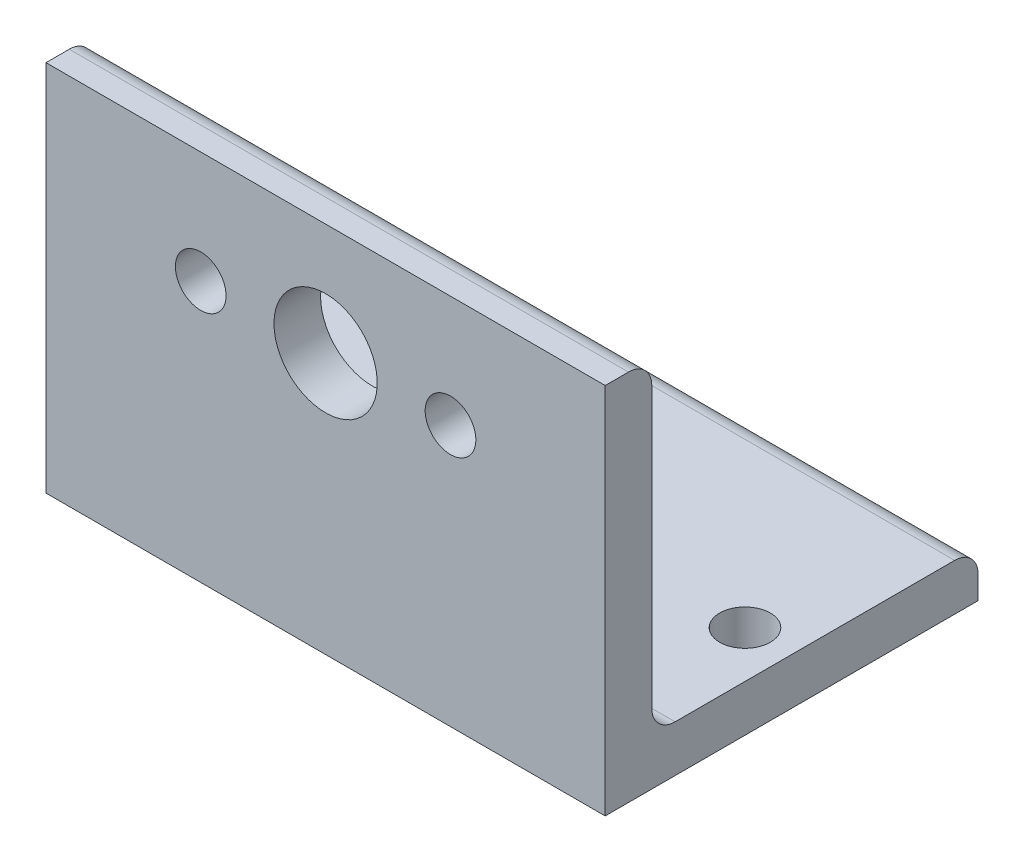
ISO-10303-21;
HEADER;
FILE_DESCRIPTION(('STEP AP214'),'2;1');
FILE_NAME('part.step','',(''),(''),'','','');
FILE_SCHEMA(('AUTOMOTIVE_DESIGN { 1 0 10303 214 1 1 1 1 }'));
ENDSEC;
DATA;
#1=APPLICATION_CONTEXT('core data for automotive mechanical design processes');
#2=APPLICATION_PROTOCOL_DEFINITION('international standard','automotive_design',2000,#1);
#3=PRODUCT_CONTEXT('',#1,'mechanical');
#4=PRODUCT('Part','Part','',(#3));
#5=PRODUCT_RELATED_PRODUCT_CATEGORY('part','',(#4));
#6=PRODUCT_DEFINITION_FORMATION('','',#4);
#7=PRODUCT_DEFINITION_CONTEXT('part definition',#1,'design');
#8=PRODUCT_DEFINITION('design','',#6,#7);
#9=PRODUCT_DEFINITION_SHAPE('','',#8);
#10=(LENGTH_UNIT() NAMED_UNIT(*) SI_UNIT(.MILLI.,.METRE.));
#11=(NAMED_UNIT(*) PLANE_ANGLE_UNIT() SI_UNIT($,.RADIAN.));
#12=(NAMED_UNIT(*) SI_UNIT($,.STERADIAN.) SOLID_ANGLE_UNIT());
#13=UNCERTAINTY_MEASURE_WITH_UNIT(LENGTH_MEASURE(1.E-05),#10,'distance_accuracy_value','');
#14=(GEOMETRIC_REPRESENTATION_CONTEXT(3) GLOBAL_UNCERTAINTY_ASSIGNED_CONTEXT((#13)) GLOBAL_UNIT_ASSIGNED_CONTEXT((#10,
#11,#12)) REPRESENTATION_CONTEXT('',''));
#15=CARTESIAN_POINT('',(0.,0.,0.));
#16=DIRECTION('',(0.,0.,1.));
#17=DIRECTION('',(1.,0.,0.));
#18=AXIS2_PLACEMENT_3D('',#15,#16,#17);
#19=CARTESIAN_POINT('',(38.1,25.4,0.));
#20=DIRECTION('',(0.,0.,-1.));
#21=DIRECTION('',(0.,1.,0.));
#22=AXIS2_PLACEMENT_3D('',#19,#20,#21);
#23=PLANE('',#22);
#24=CARTESIAN_POINT('',(27.559,17.78,0.));
#25=DIRECTION('',(0.,0.,-1.));
#26=DIRECTION('',(-1.,0.,0.));
#27=AXIS2_PLACEMENT_3D('',#24,#25,#26);
#28=CIRCLE('',#27,1.7272);
#29=CARTESIAN_POINT('',(25.8318,17.78,0.));
#30=VERTEX_POINT('',#29);
#31=EDGE_CURVE('E247',#30,#30,#28,.T.);
#32=ORIENTED_EDGE('',*,*,#31,.T.);
#33=EDGE_LOOP('',(#32));
#34=FACE_BOUND('',#33,.T.);
#35=CARTESIAN_POINT('',(10.541,17.78,0.));
#36=DIRECTION('',(0.,0.,-1.));
#37=DIRECTION('',(-1.,0.,0.));
#38=AXIS2_PLACEMENT_3D('',#35,#36,#37);
#39=CIRCLE('',#38,1.7272);
#40=CARTESIAN_POINT('',(8.8138,17.78,0.));
#41=VERTEX_POINT('',#40);
#42=EDGE_CURVE('E239',#41,#41,#39,.T.);
#43=ORIENTED_EDGE('',*,*,#42,.T.);
#44=EDGE_LOOP('',(#43));
#45=FACE_BOUND('',#44,.T.);
#46=CARTESIAN_POINT('',(19.05,17.78,0.));
#47=DIRECTION('',(0.,0.,-1.));
#48=DIRECTION('',(-1.,0.,0.));
#49=AXIS2_PLACEMENT_3D('',#46,#47,#48);
#50=CIRCLE('',#49,3.5179);
#51=CARTESIAN_POINT('',(15.5321,17.78,0.));
#52=VERTEX_POINT('',#51);
#53=EDGE_CURVE('E214',#52,#52,#50,.T.);
#54=ORIENTED_EDGE('',*,*,#53,.T.);
#55=EDGE_LOOP('',(#54));
#56=FACE_BOUND('',#55,.T.);
#57=DIRECTION('',(0.,-1.,0.));
#58=VECTOR('',#57,1.);
#59=CARTESIAN_POINT('',(0.,25.4,0.));
#60=LINE('',#59,#58);
#61=CARTESIAN_POINT('',(0.,25.4,0.));
#62=VERTEX_POINT('',#61);
#63=CARTESIAN_POINT('',(0.,0.,0.));
#64=VERTEX_POINT('',#63);
#65=EDGE_CURVE('E138',#62,#64,#60,.T.);
#66=ORIENTED_EDGE('',*,*,#65,.T.);
#67=DIRECTION('',(-1.,0.,0.));
#68=VECTOR('',#67,1.);
#69=CARTESIAN_POINT('',(38.1,0.,0.));
#70=LINE('',#69,#68);
#71=CARTESIAN_POINT('',(38.1,0.,0.));
#72=VERTEX_POINT('',#71);
#73=EDGE_CURVE('E118',#72,#64,#70,.T.);
#74=ORIENTED_EDGE('',*,*,#73,.F.);
#75=DIRECTION('',(0.,-1.,0.));
#76=VECTOR('',#75,1.);
#77=CARTESIAN_POINT('',(38.1,25.4,0.));
#78=LINE('',#77,#76);
#79=CARTESIAN_POINT('',(38.1,25.4,0.));
#80=VERTEX_POINT('',#79);
#81=EDGE_CURVE('E126',#80,#72,#78,.T.);
#82=ORIENTED_EDGE('',*,*,#81,.F.);
#83=DIRECTION('',(-1.,0.,0.));
#84=VECTOR('',#83,1.);
#85=CARTESIAN_POINT('',(38.1,25.4,0.));
#86=LINE('',#85,#84);
#87=EDGE_CURVE('E147',#80,#62,#86,.T.);
#88=ORIENTED_EDGE('',*,*,#87,.T.);
#89=EDGE_LOOP('',(#66,#74,#82,#88));
#90=FACE_BOUND('',#89,.T.);
#91=ADVANCED_FACE('F41',(#34,#45,#56,#90),#23,.F.);
#92=CARTESIAN_POINT('',(38.1,0.,0.));
#93=DIRECTION('',(0.,1.,0.));
#94=DIRECTION('',(0.,0.,1.));
#95=AXIS2_PLACEMENT_3D('',#92,#93,#94);
#96=PLANE('',#95);
#97=CARTESIAN_POINT('',(34.925,0.,-12.7));
#98=DIRECTION('',(0.,1.,0.));
#99=DIRECTION('',(0.,0.,1.));
#100=AXIS2_PLACEMENT_3D('',#97,#98,#99);
#101=CIRCLE('',#100,1.7272);
#102=CARTESIAN_POINT('',(34.925,0.,-10.9728));
#103=VERTEX_POINT('',#102);
#104=EDGE_CURVE('E263',#103,#103,#101,.T.);
#105=ORIENTED_EDGE('',*,*,#104,.T.);
#106=EDGE_LOOP('',(#105));
#107=FACE_BOUND('',#106,.T.);
#108=CARTESIAN_POINT('',(3.175,0.,-12.7));
#109=DIRECTION('',(0.,1.,0.));
#110=DIRECTION('',(0.,0.,1.));
#111=AXIS2_PLACEMENT_3D('',#108,#109,#110);
#112=CIRCLE('',#111,1.7272);
#113=CARTESIAN_POINT('',(3.175,0.,-10.9728));
#114=VERTEX_POINT('',#113);
#115=EDGE_CURVE('E255',#114,#114,#112,.T.);
#116=ORIENTED_EDGE('',*,*,#115,.T.);
#117=EDGE_LOOP('',(#116));
#118=FACE_BOUND('',#117,.T.);
#119=DIRECTION('',(0.,0.,-1.));
#120=VECTOR('',#119,1.);
#121=CARTESIAN_POINT('',(0.,0.,0.));
#122=LINE('',#121,#120);
#123=CARTESIAN_POINT('',(0.,0.,-25.4));
#124=VERTEX_POINT('',#123);
#125=EDGE_CURVE('E213',#64,#124,#122,.T.);
#126=ORIENTED_EDGE('',*,*,#125,.T.);
#127=DIRECTION('',(-1.,0.,0.));
#128=VECTOR('',#127,1.);
#129=CARTESIAN_POINT('',(38.1,0.,-25.4));
#130=LINE('',#129,#128);
#131=CARTESIAN_POINT('',(38.1,0.,-25.4));
#132=VERTEX_POINT('',#131);
#133=EDGE_CURVE('E121',#132,#124,#130,.T.);
#134=ORIENTED_EDGE('',*,*,#133,.F.);
#135=DIRECTION('',(0.,0.,-1.));
#136=VECTOR('',#135,1.);
#137=CARTESIAN_POINT('',(38.1,0.,0.));
#138=LINE('',#137,#136);
#139=EDGE_CURVE('E114',#72,#132,#138,.T.);
#140=ORIENTED_EDGE('',*,*,#139,.F.);
#141=ORIENTED_EDGE('',*,*,#73,.T.);
#142=EDGE_LOOP('',(#126,#134,#140,#141));
#143=FACE_BOUND('',#142,.T.);
#144=ADVANCED_FACE('F116',(#107,#118,#143),#96,.F.);
#145=CARTESIAN_POINT('',(38.1,0.,-25.4));
#146=DIRECTION('',(0.,0.,1.));
#147=DIRECTION('',(1.,0.,0.));
#148=AXIS2_PLACEMENT_3D('',#145,#146,#147);
#149=PLANE('',#148);
#150=DIRECTION('',(0.,1.,0.));
#151=VECTOR('',#150,1.);
#152=CARTESIAN_POINT('',(0.,0.,-25.4));
#153=LINE('',#152,#151);
#154=CARTESIAN_POINT('',(0.,1.5875,-25.4));
#155=VERTEX_POINT('',#154);
#156=EDGE_CURVE('E195',#124,#155,#153,.T.);
#157=ORIENTED_EDGE('',*,*,#156,.T.);
#158=DIRECTION('',(-1.,0.,0.));
#159=VECTOR('',#158,1.);
#160=CARTESIAN_POINT('',(38.1,1.5875,-25.4));
#161=LINE('',#160,#159);
#162=CARTESIAN_POINT('',(38.1,1.5875,-25.4));
#163=VERTEX_POINT('',#162);
#164=EDGE_CURVE('E160',#155,#163,#161,.F.);
#165=ORIENTED_EDGE('',*,*,#164,.T.);
#166=DIRECTION('',(0.,1.,0.));
#167=VECTOR('',#166,1.);
#168=CARTESIAN_POINT('',(38.1,0.,-25.4));
#169=LINE('',#168,#167);
#170=EDGE_CURVE('E125',#132,#163,#169,.T.);
#171=ORIENTED_EDGE('',*,*,#170,.F.);
#172=ORIENTED_EDGE('',*,*,#133,.T.);
#173=EDGE_LOOP('',(#157,#165,#171,#172));
#174=FACE_BOUND('',#173,.T.);
#175=ADVANCED_FACE('F229',(#174),#149,.F.);
#176=CARTESIAN_POINT('',(38.1,3.175,-25.4));
#177=DIRECTION('',(0.,-1.,0.));
#178=DIRECTION('',(0.,0.,-1.));
#179=AXIS2_PLACEMENT_3D('',#176,#177,#178);
#180=PLANE('',#179);
#181=CARTESIAN_POINT('',(34.925,3.175,-12.7));
#182=DIRECTION('',(0.,1.,0.));
#183=DIRECTION('',(0.,0.,1.));
#184=AXIS2_PLACEMENT_3D('',#181,#182,#183);
#185=CIRCLE('',#184,1.7272);
#186=CARTESIAN_POINT('',(34.925,3.175,-10.9728));
#187=VERTEX_POINT('',#186);
#188=EDGE_CURVE('E267',#187,#187,#185,.T.);
#189=ORIENTED_EDGE('',*,*,#188,.F.);
#190=EDGE_LOOP('',(#189));
#191=FACE_BOUND('',#190,.T.);
#192=CARTESIAN_POINT('',(3.175,3.175,-12.7));
#193=DIRECTION('',(0.,1.,0.));
#194=DIRECTION('',(0.,0.,1.));
#195=AXIS2_PLACEMENT_3D('',#192,#193,#194);
#196=CIRCLE('',#195,1.7272);
#197=CARTESIAN_POINT('',(3.175,3.175,-10.9728));
#198=VERTEX_POINT('',#197);
#199=EDGE_CURVE('E259',#198,#198,#196,.T.);
#200=ORIENTED_EDGE('',*,*,#199,.F.);
#201=EDGE_LOOP('',(#200));
#202=FACE_BOUND('',#201,.T.);
#203=DIRECTION('',(0.,0.,1.));
#204=VECTOR('',#203,1.);
#205=CARTESIAN_POINT('',(38.1,3.175,-25.4));
#206=LINE('',#205,#204);
#207=CARTESIAN_POINT('',(38.1,3.175,-23.8125));
#208=VERTEX_POINT('',#207);
#209=CARTESIAN_POINT('',(38.1,3.175,-4.7625));
#210=VERTEX_POINT('',#209);
#211=EDGE_CURVE('E200',#208,#210,#206,.T.);
#212=ORIENTED_EDGE('',*,*,#211,.F.);
#213=DIRECTION('',(-1.,0.,0.));
#214=VECTOR('',#213,1.);
#215=CARTESIAN_POINT('',(38.1,3.175,-23.8125));
#216=LINE('',#215,#214);
#217=CARTESIAN_POINT('',(0.,3.175,-23.8125));
#218=VERTEX_POINT('',#217);
#219=EDGE_CURVE('E145',#208,#218,#216,.T.);
#220=ORIENTED_EDGE('',*,*,#219,.T.);
#221=DIRECTION('',(0.,0.,1.));
#222=VECTOR('',#221,1.);
#223=CARTESIAN_POINT('',(0.,3.175,-25.4));
#224=LINE('',#223,#222);
#225=CARTESIAN_POINT('',(0.,3.175,-4.7625));
#226=VERTEX_POINT('',#225);
#227=EDGE_CURVE('E184',#218,#226,#224,.T.);
#228=ORIENTED_EDGE('',*,*,#227,.T.);
#229=DIRECTION('',(-1.,0.,0.));
#230=VECTOR('',#229,1.);
#231=CARTESIAN_POINT('',(38.1,3.175,-4.7625));
#232=LINE('',#231,#230);
#233=EDGE_CURVE('E140',#226,#210,#232,.F.);
#234=ORIENTED_EDGE('',*,*,#233,.T.);
#235=EDGE_LOOP('',(#212,#220,#228,#234));
#236=FACE_BOUND('',#235,.T.);
#237=ADVANCED_FACE('F191',(#191,#202,#236),#180,.F.);
#238=CARTESIAN_POINT('',(38.1,3.175,-3.175));
#239=DIRECTION('',(0.,0.,1.));
#240=DIRECTION('',(1.,0.,0.));
#241=AXIS2_PLACEMENT_3D('',#238,#239,#240);
#242=PLANE('',#241);
#243=CARTESIAN_POINT('',(27.559,17.78,-3.175));
#244=DIRECTION('',(0.,0.,-1.));
#245=DIRECTION('',(-1.,0.,0.));
#246=AXIS2_PLACEMENT_3D('',#243,#244,#245);
#247=CIRCLE('',#246,1.7272);
#248=CARTESIAN_POINT('',(25.8318,17.78,-3.175));
#249=VERTEX_POINT('',#248);
#250=EDGE_CURVE('E251',#249,#249,#247,.T.);
#251=ORIENTED_EDGE('',*,*,#250,.F.);
#252=EDGE_LOOP('',(#251));
#253=FACE_BOUND('',#252,.T.);
#254=CARTESIAN_POINT('',(10.541,17.78,-3.175));
#255=DIRECTION('',(0.,0.,-1.));
#256=DIRECTION('',(-1.,0.,0.));
#257=AXIS2_PLACEMENT_3D('',#254,#255,#256);
#258=CIRCLE('',#257,1.7272);
#259=CARTESIAN_POINT('',(8.8138,17.78,-3.175));
#260=VERTEX_POINT('',#259);
#261=EDGE_CURVE('E243',#260,#260,#258,.T.);
#262=ORIENTED_EDGE('',*,*,#261,.F.);
#263=EDGE_LOOP('',(#262));
#264=FACE_BOUND('',#263,.T.);
#265=CARTESIAN_POINT('',(19.05,17.78,-3.175));
#266=DIRECTION('',(0.,0.,-1.));
#267=DIRECTION('',(-1.,0.,0.));
#268=AXIS2_PLACEMENT_3D('',#265,#266,#267);
#269=CIRCLE('',#268,3.5179);
#270=CARTESIAN_POINT('',(15.5321,17.78,-3.175));
#271=VERTEX_POINT('',#270);
#272=EDGE_CURVE('E235',#271,#271,#269,.T.);
#273=ORIENTED_EDGE('',*,*,#272,.F.);
#274=EDGE_LOOP('',(#273));
#275=FACE_BOUND('',#274,.T.);
#276=DIRECTION('',(0.,1.,0.));
#277=VECTOR('',#276,1.);
#278=CARTESIAN_POINT('',(38.1,3.175,-3.175));
#279=LINE('',#278,#277);
#280=CARTESIAN_POINT('',(38.1,4.7625,-3.175));
#281=VERTEX_POINT('',#280);
#282=CARTESIAN_POINT('',(38.1,23.8125,-3.175));
#283=VERTEX_POINT('',#282);
#284=EDGE_CURVE('E199',#281,#283,#279,.T.);
#285=ORIENTED_EDGE('',*,*,#284,.F.);
#286=DIRECTION('',(-1.,0.,0.));
#287=VECTOR('',#286,1.);
#288=CARTESIAN_POINT('',(0.,4.7625,-3.175));
#289=LINE('',#288,#287);
#290=CARTESIAN_POINT('',(0.,4.7625,-3.175));
#291=VERTEX_POINT('',#290);
#292=EDGE_CURVE('E170',#281,#291,#289,.T.);
#293=ORIENTED_EDGE('',*,*,#292,.T.);
#294=DIRECTION('',(0.,1.,0.));
#295=VECTOR('',#294,1.);
#296=CARTESIAN_POINT('',(0.,3.175,-3.175));
#297=LINE('',#296,#295);
#298=CARTESIAN_POINT('',(0.,23.8125,-3.175));
#299=VERTEX_POINT('',#298);
#300=EDGE_CURVE('E185',#291,#299,#297,.T.);
#301=ORIENTED_EDGE('',*,*,#300,.T.);
#302=DIRECTION('',(-1.,0.,0.));
#303=VECTOR('',#302,1.);
#304=CARTESIAN_POINT('',(38.1,23.8125,-3.175));
#305=LINE('',#304,#303);
#306=EDGE_CURVE('E65',#299,#283,#305,.F.);
#307=ORIENTED_EDGE('',*,*,#306,.T.);
#308=EDGE_LOOP('',(#285,#293,#301,#307));
#309=FACE_BOUND('',#308,.T.);
#310=ADVANCED_FACE('F201',(#253,#264,#275,#309),#242,.F.);
#311=CARTESIAN_POINT('',(38.1,25.4,-3.175));
#312=DIRECTION('',(0.,-1.,0.));
#313=DIRECTION('',(0.,0.,-1.));
#314=AXIS2_PLACEMENT_3D('',#311,#312,#313);
#315=PLANE('',#314);
#316=DIRECTION('',(0.,0.,1.));
#317=VECTOR('',#316,1.);
#318=CARTESIAN_POINT('',(38.1,25.4,-3.175));
#319=LINE('',#318,#317);
#320=CARTESIAN_POINT('',(38.1,25.4,-1.5875));
#321=VERTEX_POINT('',#320);
#322=EDGE_CURVE('E130',#321,#80,#319,.T.);
#323=ORIENTED_EDGE('',*,*,#322,.F.);
#324=DIRECTION('',(-1.,0.,0.));
#325=VECTOR('',#324,1.);
#326=CARTESIAN_POINT('',(38.1,25.4,-1.5875));
#327=LINE('',#326,#325);
#328=CARTESIAN_POINT('',(0.,25.4,-1.5875));
#329=VERTEX_POINT('',#328);
#330=EDGE_CURVE('E174',#321,#329,#327,.T.);
#331=ORIENTED_EDGE('',*,*,#330,.T.);
#332=DIRECTION('',(0.,0.,1.));
#333=VECTOR('',#332,1.);
#334=CARTESIAN_POINT('',(0.,25.4,-3.175));
#335=LINE('',#334,#333);
#336=EDGE_CURVE('E135',#329,#62,#335,.T.);
#337=ORIENTED_EDGE('',*,*,#336,.T.);
#338=ORIENTED_EDGE('',*,*,#87,.F.);
#339=EDGE_LOOP('',(#323,#331,#337,#338));
#340=FACE_BOUND('',#339,.T.);
#341=ADVANCED_FACE('F323',(#340),#315,.F.);
#342=CARTESIAN_POINT('',(38.1,0.,0.));
#343=DIRECTION('',(1.,0.,0.));
#344=DIRECTION('',(0.,0.,-1.));
#345=AXIS2_PLACEMENT_3D('',#342,#343,#344);
#346=PLANE('',#345);
#347=ORIENTED_EDGE('',*,*,#170,.T.);
#348=CARTESIAN_POINT('',(38.1,1.5875,-23.8125));
#349=DIRECTION('',(1.,0.,0.));
#350=DIRECTION('',(0.,0.,-1.));
#351=AXIS2_PLACEMENT_3D('',#348,#349,#350);
#352=CIRCLE('',#351,1.5875);
#353=EDGE_CURVE('E165',#163,#208,#352,.T.);
#354=ORIENTED_EDGE('',*,*,#353,.T.);
#355=ORIENTED_EDGE('',*,*,#211,.T.);
#356=CARTESIAN_POINT('',(38.1,4.7625,-4.7625));
#357=DIRECTION('',(1.,0.,0.));
#358=DIRECTION('',(0.,0.,-1.));
#359=AXIS2_PLACEMENT_3D('',#356,#357,#358);
#360=CIRCLE('',#359,1.5875);
#361=EDGE_CURVE('E11',#210,#281,#360,.F.);
#362=ORIENTED_EDGE('',*,*,#361,.T.);
#363=ORIENTED_EDGE('',*,*,#284,.T.);
#364=CARTESIAN_POINT('',(38.1,23.8125,-1.5875));
#365=DIRECTION('',(1.,0.,0.));
#366=DIRECTION('',(0.,0.,-1.));
#367=AXIS2_PLACEMENT_3D('',#364,#365,#366);
#368=CIRCLE('',#367,1.5875);
#369=EDGE_CURVE('E57',#283,#321,#368,.T.);
#370=ORIENTED_EDGE('',*,*,#369,.T.);
#371=ORIENTED_EDGE('',*,*,#322,.T.);
#372=ORIENTED_EDGE('',*,*,#81,.T.);
#373=ORIENTED_EDGE('',*,*,#139,.T.);
#374=EDGE_LOOP('',(#347,#354,#355,#362,#363,#370,#371,#372,#373));
#375=FACE_BOUND('',#374,.T.);
#376=ADVANCED_FACE('F129',(#375),#346,.T.);
#377=CARTESIAN_POINT('',(0.,0.,0.));
#378=DIRECTION('',(1.,0.,0.));
#379=DIRECTION('',(0.,0.,-1.));
#380=AXIS2_PLACEMENT_3D('',#377,#378,#379);
#381=PLANE('',#380);
#382=ORIENTED_EDGE('',*,*,#227,.F.);
#383=CARTESIAN_POINT('',(0.,1.5875,-23.8125));
#384=DIRECTION('',(1.,0.,0.));
#385=DIRECTION('',(0.,0.,-1.));
#386=AXIS2_PLACEMENT_3D('',#383,#384,#385);
#387=CIRCLE('',#386,1.5875);
#388=EDGE_CURVE('E157',#218,#155,#387,.F.);
#389=ORIENTED_EDGE('',*,*,#388,.T.);
#390=ORIENTED_EDGE('',*,*,#156,.F.);
#391=ORIENTED_EDGE('',*,*,#125,.F.);
#392=ORIENTED_EDGE('',*,*,#65,.F.);
#393=ORIENTED_EDGE('',*,*,#336,.F.);
#394=CARTESIAN_POINT('',(0.,23.8125,-1.5875));
#395=DIRECTION('',(1.,0.,0.));
#396=DIRECTION('',(0.,0.,-1.));
#397=AXIS2_PLACEMENT_3D('',#394,#395,#396);
#398=CIRCLE('',#397,1.5875);
#399=EDGE_CURVE('E154',#329,#299,#398,.F.);
#400=ORIENTED_EDGE('',*,*,#399,.T.);
#401=ORIENTED_EDGE('',*,*,#300,.F.);
#402=CARTESIAN_POINT('',(0.,4.7625,-4.7625));
#403=DIRECTION('',(1.,0.,0.));
#404=DIRECTION('',(0.,0.,-1.));
#405=AXIS2_PLACEMENT_3D('',#402,#403,#404);
#406=CIRCLE('',#405,1.5875);
#407=EDGE_CURVE('E50',#291,#226,#406,.T.);
#408=ORIENTED_EDGE('',*,*,#407,.T.);
#409=EDGE_LOOP('',(#382,#389,#390,#391,#392,#393,#400,#401,#408));
#410=FACE_BOUND('',#409,.T.);
#411=ADVANCED_FACE('F183',(#410),#381,.F.);
#412=CARTESIAN_POINT('',(19.05,17.78,0.));
#413=DIRECTION('',(0.,0.,-1.));
#414=DIRECTION('',(-1.,0.,0.));
#415=AXIS2_PLACEMENT_3D('',#412,#413,#414);
#416=CYLINDRICAL_SURFACE('',#415,3.5179);
#417=CARTESIAN_POINT('',(15.5321,17.78,0.));
#418=CARTESIAN_POINT('',(15.5321,17.78,-0.0330729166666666));
#419=CARTESIAN_POINT('',(15.5321,17.78,-0.0661458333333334));
#420=CARTESIAN_POINT('',(15.5321,17.78,-0.132291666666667));
#421=CARTESIAN_POINT('',(15.5321,17.78,-0.165364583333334));
#422=CARTESIAN_POINT('',(15.5321,17.78,-0.231510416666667));
#423=CARTESIAN_POINT('',(15.5321,17.78,-0.264583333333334));
#424=CARTESIAN_POINT('',(15.5321,17.78,-0.330729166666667));
#425=CARTESIAN_POINT('',(15.5321,17.78,-0.363802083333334));
#426=CARTESIAN_POINT('',(15.5321,17.78,-0.429947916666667));
#427=CARTESIAN_POINT('',(15.5321,17.78,-0.463020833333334));
#428=CARTESIAN_POINT('',(15.5321,17.78,-0.529166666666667));
#429=CARTESIAN_POINT('',(15.5321,17.78,-0.562239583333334));
#430=CARTESIAN_POINT('',(15.5321,17.78,-0.628385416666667));
#431=CARTESIAN_POINT('',(15.5321,17.78,-0.661458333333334));
#432=CARTESIAN_POINT('',(15.5321,17.78,-0.727604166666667));
#433=CARTESIAN_POINT('',(15.5321,17.78,-0.760677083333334));
#434=CARTESIAN_POINT('',(15.5321,17.78,-0.826822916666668));
#435=CARTESIAN_POINT('',(15.5321,17.78,-0.859895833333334));
#436=CARTESIAN_POINT('',(15.5321,17.78,-0.926041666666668));
#437=CARTESIAN_POINT('',(15.5321,17.78,-0.959114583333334));
#438=CARTESIAN_POINT('',(15.5321,17.78,-1.02526041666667));
#439=CARTESIAN_POINT('',(15.5321,17.78,-1.05833333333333));
#440=CARTESIAN_POINT('',(15.5321,17.78,-1.12447916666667));
#441=CARTESIAN_POINT('',(15.5321,17.78,-1.15755208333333));
#442=CARTESIAN_POINT('',(15.5321,17.78,-1.22369791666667));
#443=CARTESIAN_POINT('',(15.5321,17.78,-1.25677083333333));
#444=CARTESIAN_POINT('',(15.5321,17.78,-1.32291666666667));
#445=CARTESIAN_POINT('',(15.5321,17.78,-1.35598958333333));
#446=CARTESIAN_POINT('',(15.5321,17.78,-1.42213541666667));
#447=CARTESIAN_POINT('',(15.5321,17.78,-1.45520833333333));
#448=CARTESIAN_POINT('',(15.5321,17.78,-1.52135416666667));
#449=CARTESIAN_POINT('',(15.5321,17.78,-1.55442708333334));
#450=CARTESIAN_POINT('',(15.5321,17.78,-1.62057291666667));
#451=CARTESIAN_POINT('',(15.5321,17.78,-1.65364583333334));
#452=CARTESIAN_POINT('',(15.5321,17.78,-1.71979166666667));
#453=CARTESIAN_POINT('',(15.5321,17.78,-1.75286458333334));
#454=CARTESIAN_POINT('',(15.5321,17.78,-1.81901041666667));
#455=CARTESIAN_POINT('',(15.5321,17.78,-1.85208333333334));
#456=CARTESIAN_POINT('',(15.5321,17.78,-1.91822916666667));
#457=CARTESIAN_POINT('',(15.5321,17.78,-1.95130208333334));
#458=CARTESIAN_POINT('',(15.5321,17.78,-2.01744791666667));
#459=CARTESIAN_POINT('',(15.5321,17.78,-2.05052083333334));
#460=CARTESIAN_POINT('',(15.5321,17.78,-2.11666666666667));
#461=CARTESIAN_POINT('',(15.5321,17.78,-2.14973958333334));
#462=CARTESIAN_POINT('',(15.5321,17.78,-2.21588541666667));
#463=CARTESIAN_POINT('',(15.5321,17.78,-2.24895833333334));
#464=CARTESIAN_POINT('',(15.5321,17.78,-2.31510416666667));
#465=CARTESIAN_POINT('',(15.5321,17.78,-2.34817708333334));
#466=CARTESIAN_POINT('',(15.5321,17.78,-2.41432291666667));
#467=CARTESIAN_POINT('',(15.5321,17.78,-2.44739583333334));
#468=CARTESIAN_POINT('',(15.5321,17.78,-2.51354166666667));
#469=CARTESIAN_POINT('',(15.5321,17.78,-2.54661458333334));
#470=CARTESIAN_POINT('',(15.5321,17.78,-2.61276041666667));
#471=CARTESIAN_POINT('',(15.5321,17.78,-2.64583333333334));
#472=CARTESIAN_POINT('',(15.5321,17.78,-2.71197916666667));
#473=CARTESIAN_POINT('',(15.5321,17.78,-2.74505208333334));
#474=CARTESIAN_POINT('',(15.5321,17.78,-2.81119791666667));
#475=CARTESIAN_POINT('',(15.5321,17.78,-2.84427083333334));
#476=CARTESIAN_POINT('',(15.5321,17.78,-2.91041666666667));
#477=CARTESIAN_POINT('',(15.5321,17.78,-2.94348958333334));
#478=CARTESIAN_POINT('',(15.5321,17.78,-3.00963541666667));
#479=CARTESIAN_POINT('',(15.5321,17.78,-3.04270833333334));
#480=CARTESIAN_POINT('',(15.5321,17.78,-3.10885416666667));
#481=CARTESIAN_POINT('',(15.5321,17.78,-3.14192708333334));
#482=CARTESIAN_POINT('',(15.5321,17.78,-3.175));
#483=B_SPLINE_CURVE_WITH_KNOTS('',3,(#417,#418,#419,#420,#421,#422,#423,#424,#425,#426,#427,
#428,#429,#430,#431,#432,#433,#434,#435,#436,#437,#438,#439,#440,#441,#442,#443,#444,#445,#446,
#447,#448,#449,#450,#451,#452,#453,#454,#455,#456,#457,#458,#459,#460,#461,#462,#463,#464,#465,
#466,#467,#468,#469,#470,#471,#472,#473,#474,#475,#476,#477,#478,#479,#480,#481,#482),
.UNSPECIFIED.,.F.,.F.,(4,2,2,2,2,2,2,2,2,2,2,2,2,2,2,2,2,2,2,2,2,2,2,2,2,2,2,2,2,2,2,2,4),(0.,
0.0992187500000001,0.1984375,0.29765625,0.396875,0.496093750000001,0.595312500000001,
0.694531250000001,0.793750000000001,0.892968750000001,0.992187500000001,1.09140625,1.190625,
1.28984375,1.3890625,1.48828125,1.5875,1.68671875,1.7859375,1.88515625,1.984375,2.08359375,
2.1828125,2.28203125,2.38125,2.48046875,2.5796875,2.67890625,2.778125,2.87734375,2.9765625,
3.07578125,3.175),.UNSPECIFIED.);
#484=EDGE_CURVE('BSEAM370',#52,#271,#483,.T.);
#485=ORIENTED_EDGE('',*,*,#53,.F.);
#486=ORIENTED_EDGE('',*,*,#272,.T.);
#487=ORIENTED_EDGE('',*,*,#484,.T.);
#488=ORIENTED_EDGE('',*,*,#484,.F.);
#489=EDGE_LOOP('',(#485,#487,#486,#488));
#490=FACE_BOUND('',#489,.T.);
#491=ADVANCED_FACE('F370',(#490),#416,.F.);
#492=CARTESIAN_POINT('',(10.541,17.78,0.));
#493=DIRECTION('',(0.,0.,-1.));
#494=DIRECTION('',(-1.,0.,0.));
#495=AXIS2_PLACEMENT_3D('',#492,#493,#494);
#496=CYLINDRICAL_SURFACE('',#495,1.7272);
#497=CARTESIAN_POINT('',(8.8138,17.78,0.));
#498=CARTESIAN_POINT('',(8.8138,17.78,-0.0330729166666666));
#499=CARTESIAN_POINT('',(8.8138,17.78,-0.0661458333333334));
#500=CARTESIAN_POINT('',(8.8138,17.78,-0.132291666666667));
#501=CARTESIAN_POINT('',(8.8138,17.78,-0.165364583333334));
#502=CARTESIAN_POINT('',(8.8138,17.78,-0.231510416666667));
#503=CARTESIAN_POINT('',(8.8138,17.78,-0.264583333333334));
#504=CARTESIAN_POINT('',(8.8138,17.78,-0.330729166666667));
#505=CARTESIAN_POINT('',(8.8138,17.78,-0.363802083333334));
#506=CARTESIAN_POINT('',(8.8138,17.78,-0.429947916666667));
#507=CARTESIAN_POINT('',(8.8138,17.78,-0.463020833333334));
#508=CARTESIAN_POINT('',(8.8138,17.78,-0.529166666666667));
#509=CARTESIAN_POINT('',(8.8138,17.78,-0.562239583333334));
#510=CARTESIAN_POINT('',(8.8138,17.78,-0.628385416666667));
#511=CARTESIAN_POINT('',(8.8138,17.78,-0.661458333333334));
#512=CARTESIAN_POINT('',(8.8138,17.78,-0.727604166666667));
#513=CARTESIAN_POINT('',(8.8138,17.78,-0.760677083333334));
#514=CARTESIAN_POINT('',(8.8138,17.78,-0.826822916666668));
#515=CARTESIAN_POINT('',(8.8138,17.78,-0.859895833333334));
#516=CARTESIAN_POINT('',(8.8138,17.78,-0.926041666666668));
#517=CARTESIAN_POINT('',(8.8138,17.78,-0.959114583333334));
#518=CARTESIAN_POINT('',(8.8138,17.78,-1.02526041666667));
#519=CARTESIAN_POINT('',(8.8138,17.78,-1.05833333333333));
#520=CARTESIAN_POINT('',(8.8138,17.78,-1.12447916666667));
#521=CARTESIAN_POINT('',(8.8138,17.78,-1.15755208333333));
#522=CARTESIAN_POINT('',(8.8138,17.78,-1.22369791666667));
#523=CARTESIAN_POINT('',(8.8138,17.78,-1.25677083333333));
#524=CARTESIAN_POINT('',(8.8138,17.78,-1.32291666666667));
#525=CARTESIAN_POINT('',(8.8138,17.78,-1.35598958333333));
#526=CARTESIAN_POINT('',(8.8138,17.78,-1.42213541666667));
#527=CARTESIAN_POINT('',(8.8138,17.78,-1.45520833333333));
#528=CARTESIAN_POINT('',(8.8138,17.78,-1.52135416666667));
#529=CARTESIAN_POINT('',(8.8138,17.78,-1.55442708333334));
#530=CARTESIAN_POINT('',(8.8138,17.78,-1.62057291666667));
#531=CARTESIAN_POINT('',(8.8138,17.78,-1.65364583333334));
#532=CARTESIAN_POINT('',(8.8138,17.78,-1.71979166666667));
#533=CARTESIAN_POINT('',(8.8138,17.78,-1.75286458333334));
#534=CARTESIAN_POINT('',(8.8138,17.78,-1.81901041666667));
#535=CARTESIAN_POINT('',(8.8138,17.78,-1.85208333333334));
#536=CARTESIAN_POINT('',(8.8138,17.78,-1.91822916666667));
#537=CARTESIAN_POINT('',(8.8138,17.78,-1.95130208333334));
#538=CARTESIAN_POINT('',(8.8138,17.78,-2.01744791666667));
#539=CARTESIAN_POINT('',(8.8138,17.78,-2.05052083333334));
#540=CARTESIAN_POINT('',(8.8138,17.78,-2.11666666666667));
#541=CARTESIAN_POINT('',(8.8138,17.78,-2.14973958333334));
#542=CARTESIAN_POINT('',(8.8138,17.78,-2.21588541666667));
#543=CARTESIAN_POINT('',(8.8138,17.78,-2.24895833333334));
#544=CARTESIAN_POINT('',(8.8138,17.78,-2.31510416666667));
#545=CARTESIAN_POINT('',(8.8138,17.78,-2.34817708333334));
#546=CARTESIAN_POINT('',(8.8138,17.78,-2.41432291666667));
#547=CARTESIAN_POINT('',(8.8138,17.78,-2.44739583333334));
#548=CARTESIAN_POINT('',(8.8138,17.78,-2.51354166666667));
#549=CARTESIAN_POINT('',(8.8138,17.78,-2.54661458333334));
#550=CARTESIAN_POINT('',(8.8138,17.78,-2.61276041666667));
#551=CARTESIAN_POINT('',(8.8138,17.78,-2.64583333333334));
#552=CARTESIAN_POINT('',(8.8138,17.78,-2.71197916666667));
#553=CARTESIAN_POINT('',(8.8138,17.78,-2.74505208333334));
#554=CARTESIAN_POINT('',(8.8138,17.78,-2.81119791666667));
#555=CARTESIAN_POINT('',(8.8138,17.78,-2.84427083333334));
#556=CARTESIAN_POINT('',(8.8138,17.78,-2.91041666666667));
#557=CARTESIAN_POINT('',(8.8138,17.78,-2.94348958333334));
#558=CARTESIAN_POINT('',(8.8138,17.78,-3.00963541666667));
#559=CARTESIAN_POINT('',(8.8138,17.78,-3.04270833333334));
#560=CARTESIAN_POINT('',(8.8138,17.78,-3.10885416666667));
#561=CARTESIAN_POINT('',(8.8138,17.78,-3.14192708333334));
#562=CARTESIAN_POINT('',(8.8138,17.78,-3.175));
#563=B_SPLINE_CURVE_WITH_KNOTS('',3,(#497,#498,#499,#500,#501,#502,#503,#504,#505,#506,#507,
#508,#509,#510,#511,#512,#513,#514,#515,#516,#517,#518,#519,#520,#521,#522,#523,#524,#525,#526,
#527,#528,#529,#530,#531,#532,#533,#534,#535,#536,#537,#538,#539,#540,#541,#542,#543,#544,#545,
#546,#547,#548,#549,#550,#551,#552,#553,#554,#555,#556,#557,#558,#559,#560,#561,#562),
.UNSPECIFIED.,.F.,.F.,(4,2,2,2,2,2,2,2,2,2,2,2,2,2,2,2,2,2,2,2,2,2,2,2,2,2,2,2,2,2,2,2,4),(0.,
0.0992187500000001,0.1984375,0.29765625,0.396875,0.496093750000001,0.595312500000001,
0.694531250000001,0.793750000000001,0.892968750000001,0.992187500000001,1.09140625,1.190625,
1.28984375,1.3890625,1.48828125,1.5875,1.68671875,1.7859375,1.88515625,1.984375,2.08359375,
2.1828125,2.28203125,2.38125,2.48046875,2.5796875,2.67890625,2.778125,2.87734375,2.9765625,
3.07578125,3.175),.UNSPECIFIED.);
#564=EDGE_CURVE('BSEAM299',#41,#260,#563,.T.);
#565=ORIENTED_EDGE('',*,*,#42,.F.);
#566=ORIENTED_EDGE('',*,*,#261,.T.);
#567=ORIENTED_EDGE('',*,*,#564,.T.);
#568=ORIENTED_EDGE('',*,*,#564,.F.);
#569=EDGE_LOOP('',(#565,#567,#566,#568));
#570=FACE_BOUND('',#569,.T.);
#571=ADVANCED_FACE('F299',(#570),#496,.F.);
#572=CARTESIAN_POINT('',(27.559,17.78,0.));
#573=DIRECTION('',(0.,0.,-1.));
#574=DIRECTION('',(-1.,0.,0.));
#575=AXIS2_PLACEMENT_3D('',#572,#573,#574);
#576=CYLINDRICAL_SURFACE('',#575,1.7272);
#577=CARTESIAN_POINT('',(25.8318,17.78,0.));
#578=CARTESIAN_POINT('',(25.8318,17.78,-0.0330729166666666));
#579=CARTESIAN_POINT('',(25.8318,17.78,-0.0661458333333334));
#580=CARTESIAN_POINT('',(25.8318,17.78,-0.132291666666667));
#581=CARTESIAN_POINT('',(25.8318,17.78,-0.165364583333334));
#582=CARTESIAN_POINT('',(25.8318,17.78,-0.231510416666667));
#583=CARTESIAN_POINT('',(25.8318,17.78,-0.264583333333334));
#584=CARTESIAN_POINT('',(25.8318,17.78,-0.330729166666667));
#585=CARTESIAN_POINT('',(25.8318,17.78,-0.363802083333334));
#586=CARTESIAN_POINT('',(25.8318,17.78,-0.429947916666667));
#587=CARTESIAN_POINT('',(25.8318,17.78,-0.463020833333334));
#588=CARTESIAN_POINT('',(25.8318,17.78,-0.529166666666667));
#589=CARTESIAN_POINT('',(25.8318,17.78,-0.562239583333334));
#590=CARTESIAN_POINT('',(25.8318,17.78,-0.628385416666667));
#591=CARTESIAN_POINT('',(25.8318,17.78,-0.661458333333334));
#592=CARTESIAN_POINT('',(25.8318,17.78,-0.727604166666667));
#593=CARTESIAN_POINT('',(25.8318,17.78,-0.760677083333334));
#594=CARTESIAN_POINT('',(25.8318,17.78,-0.826822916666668));
#595=CARTESIAN_POINT('',(25.8318,17.78,-0.859895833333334));
#596=CARTESIAN_POINT('',(25.8318,17.78,-0.926041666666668));
#597=CARTESIAN_POINT('',(25.8318,17.78,-0.959114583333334));
#598=CARTESIAN_POINT('',(25.8318,17.78,-1.02526041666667));
#599=CARTESIAN_POINT('',(25.8318,17.78,-1.05833333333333));
#600=CARTESIAN_POINT('',(25.8318,17.78,-1.12447916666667));
#601=CARTESIAN_POINT('',(25.8318,17.78,-1.15755208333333));
#602=CARTESIAN_POINT('',(25.8318,17.78,-1.22369791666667));
#603=CARTESIAN_POINT('',(25.8318,17.78,-1.25677083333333));
#604=CARTESIAN_POINT('',(25.8318,17.78,-1.32291666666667));
#605=CARTESIAN_POINT('',(25.8318,17.78,-1.35598958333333));
#606=CARTESIAN_POINT('',(25.8318,17.78,-1.42213541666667));
#607=CARTESIAN_POINT('',(25.8318,17.78,-1.45520833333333));
#608=CARTESIAN_POINT('',(25.8318,17.78,-1.52135416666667));
#609=CARTESIAN_POINT('',(25.8318,17.78,-1.55442708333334));
#610=CARTESIAN_POINT('',(25.8318,17.78,-1.62057291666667));
#611=CARTESIAN_POINT('',(25.8318,17.78,-1.65364583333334));
#612=CARTESIAN_POINT('',(25.8318,17.78,-1.71979166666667));
#613=CARTESIAN_POINT('',(25.8318,17.78,-1.75286458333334));
#614=CARTESIAN_POINT('',(25.8318,17.78,-1.81901041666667));
#615=CARTESIAN_POINT('',(25.8318,17.78,-1.85208333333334));
#616=CARTESIAN_POINT('',(25.8318,17.78,-1.91822916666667));
#617=CARTESIAN_POINT('',(25.8318,17.78,-1.95130208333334));
#618=CARTESIAN_POINT('',(25.8318,17.78,-2.01744791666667));
#619=CARTESIAN_POINT('',(25.8318,17.78,-2.05052083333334));
#620=CARTESIAN_POINT('',(25.8318,17.78,-2.11666666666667));
#621=CARTESIAN_POINT('',(25.8318,17.78,-2.14973958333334));
#622=CARTESIAN_POINT('',(25.8318,17.78,-2.21588541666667));
#623=CARTESIAN_POINT('',(25.8318,17.78,-2.24895833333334));
#624=CARTESIAN_POINT('',(25.8318,17.78,-2.31510416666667));
#625=CARTESIAN_POINT('',(25.8318,17.78,-2.34817708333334));
#626=CARTESIAN_POINT('',(25.8318,17.78,-2.41432291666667));
#627=CARTESIAN_POINT('',(25.8318,17.78,-2.44739583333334));
#628=CARTESIAN_POINT('',(25.8318,17.78,-2.51354166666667));
#629=CARTESIAN_POINT('',(25.8318,17.78,-2.54661458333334));
#630=CARTESIAN_POINT('',(25.8318,17.78,-2.61276041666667));
#631=CARTESIAN_POINT('',(25.8318,17.78,-2.64583333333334));
#632=CARTESIAN_POINT('',(25.8318,17.78,-2.71197916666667));
#633=CARTESIAN_POINT('',(25.8318,17.78,-2.74505208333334));
#634=CARTESIAN_POINT('',(25.8318,17.78,-2.81119791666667));
#635=CARTESIAN_POINT('',(25.8318,17.78,-2.84427083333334));
#636=CARTESIAN_POINT('',(25.8318,17.78,-2.91041666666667));
#637=CARTESIAN_POINT('',(25.8318,17.78,-2.94348958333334));
#638=CARTESIAN_POINT('',(25.8318,17.78,-3.00963541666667));
#639=CARTESIAN_POINT('',(25.8318,17.78,-3.04270833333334));
#640=CARTESIAN_POINT('',(25.8318,17.78,-3.10885416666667));
#641=CARTESIAN_POINT('',(25.8318,17.78,-3.14192708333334));
#642=CARTESIAN_POINT('',(25.8318,17.78,-3.175));
#643=B_SPLINE_CURVE_WITH_KNOTS('',3,(#577,#578,#579,#580,#581,#582,#583,#584,#585,#586,#587,
#588,#589,#590,#591,#592,#593,#594,#595,#596,#597,#598,#599,#600,#601,#602,#603,#604,#605,#606,
#607,#608,#609,#610,#611,#612,#613,#614,#615,#616,#617,#618,#619,#620,#621,#622,#623,#624,#625,
#626,#627,#628,#629,#630,#631,#632,#633,#634,#635,#636,#637,#638,#639,#640,#641,#642),
.UNSPECIFIED.,.F.,.F.,(4,2,2,2,2,2,2,2,2,2,2,2,2,2,2,2,2,2,2,2,2,2,2,2,2,2,2,2,2,2,2,2,4),(0.,
0.0992187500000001,0.1984375,0.29765625,0.396875,0.496093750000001,0.595312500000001,
0.694531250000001,0.793750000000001,0.892968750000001,0.992187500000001,1.09140625,1.190625,
1.28984375,1.3890625,1.48828125,1.5875,1.68671875,1.7859375,1.88515625,1.984375,2.08359375,
2.1828125,2.28203125,2.38125,2.48046875,2.5796875,2.67890625,2.778125,2.87734375,2.9765625,
3.07578125,3.175),.UNSPECIFIED.);
#644=EDGE_CURVE('BSEAM292',#30,#249,#643,.T.);
#645=ORIENTED_EDGE('',*,*,#31,.F.);
#646=ORIENTED_EDGE('',*,*,#250,.T.);
#647=ORIENTED_EDGE('',*,*,#644,.T.);
#648=ORIENTED_EDGE('',*,*,#644,.F.);
#649=EDGE_LOOP('',(#645,#647,#646,#648));
#650=FACE_BOUND('',#649,.T.);
#651=ADVANCED_FACE('F292',(#650),#576,.F.);
#652=CARTESIAN_POINT('',(3.175,0.,-12.7));
#653=DIRECTION('',(0.,1.,0.));
#654=DIRECTION('',(0.,0.,1.));
#655=AXIS2_PLACEMENT_3D('',#652,#653,#654);
#656=CYLINDRICAL_SURFACE('',#655,1.7272);
#657=ORIENTED_EDGE('',*,*,#115,.F.);
#658=EDGE_LOOP('',(#657));
#659=FACE_BOUND('',#658,.T.);
#660=ORIENTED_EDGE('',*,*,#199,.T.);
#661=EDGE_LOOP('',(#660));
#662=FACE_BOUND('',#661,.T.);
#663=ADVANCED_FACE('F282',(#659,#662),#656,.F.);
#664=CARTESIAN_POINT('',(34.925,0.,-12.7));
#665=DIRECTION('',(0.,1.,0.));
#666=DIRECTION('',(0.,0.,1.));
#667=AXIS2_PLACEMENT_3D('',#664,#665,#666);
#668=CYLINDRICAL_SURFACE('',#667,1.7272);
#669=ORIENTED_EDGE('',*,*,#104,.F.);
#670=EDGE_LOOP('',(#669));
#671=FACE_BOUND('',#670,.T.);
#672=ORIENTED_EDGE('',*,*,#188,.T.);
#673=EDGE_LOOP('',(#672));
#674=FACE_BOUND('',#673,.T.);
#675=ADVANCED_FACE('F278',(#671,#674),#668,.F.);
#676=CARTESIAN_POINT('',(38.1,1.5875,-23.8125));
#677=DIRECTION('',(-1.,0.,0.));
#678=DIRECTION('',(0.,0.,1.));
#679=AXIS2_PLACEMENT_3D('',#676,#677,#678);
#680=CYLINDRICAL_SURFACE('',#679,1.5875);
#681=ORIENTED_EDGE('',*,*,#353,.F.);
#682=ORIENTED_EDGE('',*,*,#164,.F.);
#683=ORIENTED_EDGE('',*,*,#388,.F.);
#684=ORIENTED_EDGE('',*,*,#219,.F.);
#685=EDGE_LOOP('',(#681,#682,#683,#684));
#686=FACE_BOUND('',#685,.T.);
#687=ADVANCED_FACE('F281',(#686),#680,.T.);
#688=CARTESIAN_POINT('',(38.1,4.7625,-4.7625));
#689=DIRECTION('',(1.,0.,0.));
#690=DIRECTION('',(0.,0.,-1.));
#691=AXIS2_PLACEMENT_3D('',#688,#689,#690);
#692=CYLINDRICAL_SURFACE('',#691,1.5875);
#693=ORIENTED_EDGE('',*,*,#361,.F.);
#694=ORIENTED_EDGE('',*,*,#233,.F.);
#695=ORIENTED_EDGE('',*,*,#407,.F.);
#696=ORIENTED_EDGE('',*,*,#292,.F.);
#697=EDGE_LOOP('',(#693,#694,#695,#696));
#698=FACE_BOUND('',#697,.T.);
#699=ADVANCED_FACE('F198',(#698),#692,.F.);
#700=CARTESIAN_POINT('',(38.1,23.8125,-1.5875));
#701=DIRECTION('',(-1.,0.,0.));
#702=DIRECTION('',(0.,0.,1.));
#703=AXIS2_PLACEMENT_3D('',#700,#701,#702);
#704=CYLINDRICAL_SURFACE('',#703,1.5875);
#705=ORIENTED_EDGE('',*,*,#369,.F.);
#706=ORIENTED_EDGE('',*,*,#306,.F.);
#707=ORIENTED_EDGE('',*,*,#399,.F.);
#708=ORIENTED_EDGE('',*,*,#330,.F.);
#709=EDGE_LOOP('',(#705,#706,#707,#708));
#710=FACE_BOUND('',#709,.T.);
#711=ADVANCED_FACE('F43',(#710),#704,.T.);
#712=CLOSED_SHELL('',(#91,#144,#175,#237,#310,#341,#376,#411,#491,#571,#651,#663,#675,#687,#699,#711));
#713=MANIFOLD_SOLID_BREP('B2',#712);
#714=ADVANCED_BREP_SHAPE_REPRESENTATION('',(#18,#713),#14);
#715=SHAPE_DEFINITION_REPRESENTATION(#9,#714);
ENDSEC;
END-ISO-10303-21;
